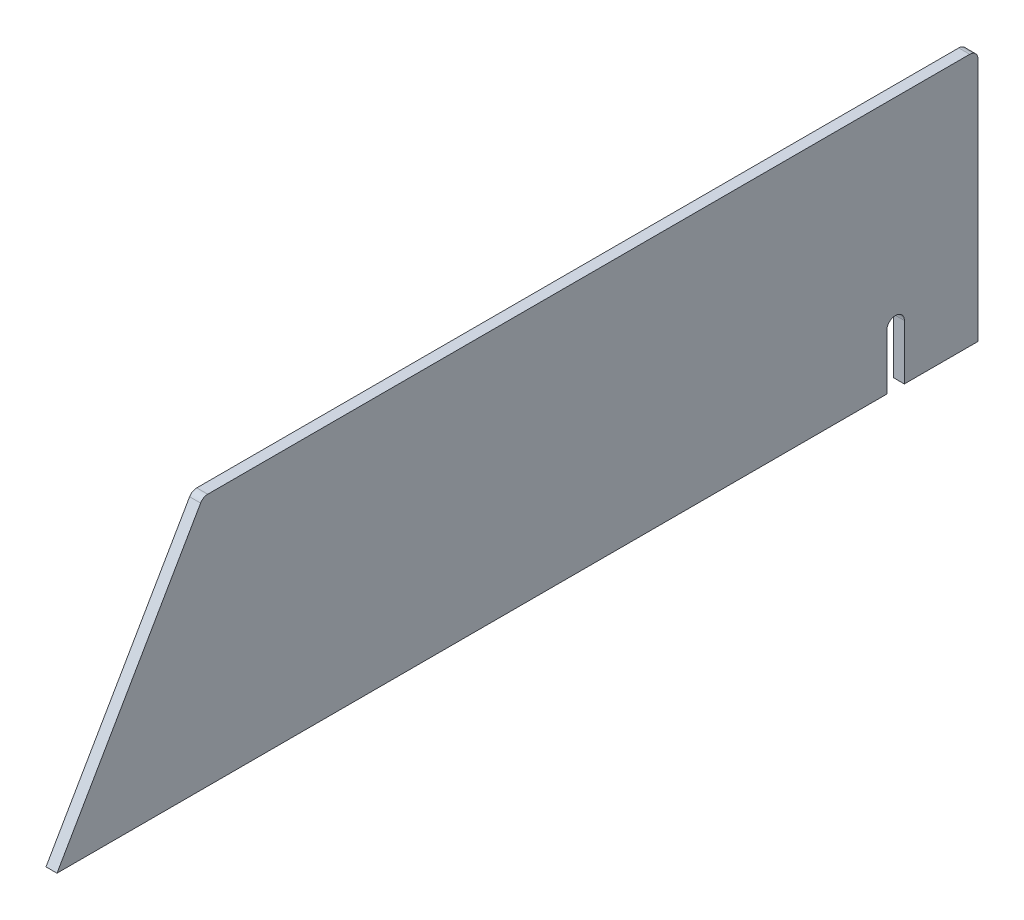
ISO-10303-21;
HEADER;
FILE_DESCRIPTION(('STEP AP214'),'2;1');
FILE_NAME('part.step','',(''),(''),'','','');
FILE_SCHEMA(('AUTOMOTIVE_DESIGN { 1 0 10303 214 1 1 1 1 }'));
ENDSEC;
DATA;
#1=APPLICATION_CONTEXT('core data for automotive mechanical design processes');
#2=APPLICATION_PROTOCOL_DEFINITION('international standard','automotive_design',2000,#1);
#3=PRODUCT_CONTEXT('',#1,'mechanical');
#4=PRODUCT('Part','Part','',(#3));
#5=PRODUCT_RELATED_PRODUCT_CATEGORY('part','',(#4));
#6=PRODUCT_DEFINITION_FORMATION('','',#4);
#7=PRODUCT_DEFINITION_CONTEXT('part definition',#1,'design');
#8=PRODUCT_DEFINITION('design','',#6,#7);
#9=PRODUCT_DEFINITION_SHAPE('','',#8);
#10=(LENGTH_UNIT() NAMED_UNIT(*) SI_UNIT(.MILLI.,.METRE.));
#11=(NAMED_UNIT(*) PLANE_ANGLE_UNIT() SI_UNIT($,.RADIAN.));
#12=(NAMED_UNIT(*) SI_UNIT($,.STERADIAN.) SOLID_ANGLE_UNIT());
#13=UNCERTAINTY_MEASURE_WITH_UNIT(LENGTH_MEASURE(1.E-05),#10,'distance_accuracy_value','');
#14=(GEOMETRIC_REPRESENTATION_CONTEXT(3) GLOBAL_UNCERTAINTY_ASSIGNED_CONTEXT((#13)) GLOBAL_UNIT_ASSIGNED_CONTEXT((#10,
#11,#12)) REPRESENTATION_CONTEXT('',''));
#15=CARTESIAN_POINT('',(0.,0.,0.));
#16=DIRECTION('',(0.,0.,1.));
#17=DIRECTION('',(1.,0.,0.));
#18=AXIS2_PLACEMENT_3D('',#15,#16,#17);
#19=CARTESIAN_POINT('',(2.,-46.,-55.));
#20=DIRECTION('',(0.,1.,0.));
#21=DIRECTION('',(0.,0.,1.));
#22=AXIS2_PLACEMENT_3D('',#19,#20,#21);
#23=PLANE('',#22);
#24=DIRECTION('',(0.,0.,-1.));
#25=VECTOR('',#24,1.);
#26=CARTESIAN_POINT('',(2.,-46.,-55.));
#27=LINE('',#26,#25);
#28=CARTESIAN_POINT('',(2.,-46.,-41.6));
#29=VERTEX_POINT('',#28);
#30=CARTESIAN_POINT('',(2.,-46.,-55.));
#31=VERTEX_POINT('',#30);
#32=EDGE_CURVE('E148',#29,#31,#27,.T.);
#33=ORIENTED_EDGE('',*,*,#32,.F.);
#34=DIRECTION('',(-1.,0.,0.));
#35=VECTOR('',#34,1.);
#36=CARTESIAN_POINT('',(2.,-46.,-41.6));
#37=LINE('',#36,#35);
#38=CARTESIAN_POINT('',(0.,-46.,-41.6));
#39=VERTEX_POINT('',#38);
#40=EDGE_CURVE('E138',#29,#39,#37,.T.);
#41=ORIENTED_EDGE('',*,*,#40,.T.);
#42=DIRECTION('',(0.,0.,-1.));
#43=VECTOR('',#42,1.);
#44=CARTESIAN_POINT('',(0.,-46.,-55.));
#45=LINE('',#44,#43);
#46=CARTESIAN_POINT('',(0.,-46.,-55.));
#47=VERTEX_POINT('',#46);
#48=EDGE_CURVE('E156',#39,#47,#45,.T.);
#49=ORIENTED_EDGE('',*,*,#48,.T.);
#50=DIRECTION('',(-1.,0.,0.));
#51=VECTOR('',#50,1.);
#52=CARTESIAN_POINT('',(2.,-46.,-55.));
#53=LINE('',#52,#51);
#54=EDGE_CURVE('E154',#31,#47,#53,.T.);
#55=ORIENTED_EDGE('',*,*,#54,.F.);
#56=EDGE_LOOP('',(#33,#41,#49,#55));
#57=FACE_BOUND('',#56,.T.);
#58=ADVANCED_FACE('F32',(#57),#23,.F.);
#59=CARTESIAN_POINT('',(2.,-46.,112.558112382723));
#60=DIRECTION('',(0.,-0.500000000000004,-0.866025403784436));
#61=DIRECTION('',(0.,0.866025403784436,-0.500000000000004));
#62=AXIS2_PLACEMENT_3D('',#59,#60,#61);
#63=PLANE('',#62);
#64=DIRECTION('',(0.,-0.866025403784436,0.500000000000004));
#65=VECTOR('',#64,1.);
#66=CARTESIAN_POINT('',(2.,-46.,112.558112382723));
#67=LINE('',#66,#65);
#68=CARTESIAN_POINT('',(2.,-0.749999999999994,86.4330127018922));
#69=VERTEX_POINT('',#68);
#70=CARTESIAN_POINT('',(2.,-46.,112.558112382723));
#71=VERTEX_POINT('',#70);
#72=EDGE_CURVE('E145',#69,#71,#67,.T.);
#73=ORIENTED_EDGE('',*,*,#72,.F.);
#74=DIRECTION('',(-1.,0.,0.));
#75=VECTOR('',#74,1.);
#76=CARTESIAN_POINT('',(2.,-0.750000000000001,86.4330127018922));
#77=LINE('',#76,#75);
#78=CARTESIAN_POINT('',(0.,-0.749999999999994,86.4330127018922));
#79=VERTEX_POINT('',#78);
#80=EDGE_CURVE('E168',#69,#79,#77,.T.);
#81=ORIENTED_EDGE('',*,*,#80,.T.);
#82=DIRECTION('',(0.,-0.866025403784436,0.500000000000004));
#83=VECTOR('',#82,1.);
#84=CARTESIAN_POINT('',(0.,-46.,112.558112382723));
#85=LINE('',#84,#83);
#86=CARTESIAN_POINT('',(0.,-46.,112.558112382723));
#87=VERTEX_POINT('',#86);
#88=EDGE_CURVE('E141',#79,#87,#85,.T.);
#89=ORIENTED_EDGE('',*,*,#88,.T.);
#90=DIRECTION('',(-1.,0.,0.));
#91=VECTOR('',#90,1.);
#92=CARTESIAN_POINT('',(2.,-46.,112.558112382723));
#93=LINE('',#92,#91);
#94=EDGE_CURVE('E165',#71,#87,#93,.T.);
#95=ORIENTED_EDGE('',*,*,#94,.F.);
#96=EDGE_LOOP('',(#73,#81,#89,#95));
#97=FACE_BOUND('',#96,.T.);
#98=ADVANCED_FACE('F193',(#97),#63,.F.);
#99=CARTESIAN_POINT('',(0.,-46.,-38.4));
#100=VERTEX_POINT('',#99);
#101=EDGE_CURVE('E157',#87,#100,#45,.T.);
#102=ORIENTED_EDGE('',*,*,#101,.T.);
#103=DIRECTION('',(1.,0.,0.));
#104=VECTOR('',#103,1.);
#105=CARTESIAN_POINT('',(2.,-46.,-38.4));
#106=LINE('',#105,#104);
#107=CARTESIAN_POINT('',(2.,-46.,-38.4));
#108=VERTEX_POINT('',#107);
#109=EDGE_CURVE('E47',#100,#108,#106,.T.);
#110=ORIENTED_EDGE('',*,*,#109,.T.);
#111=EDGE_CURVE('E149',#71,#108,#27,.T.);
#112=ORIENTED_EDGE('',*,*,#111,.F.);
#113=ORIENTED_EDGE('',*,*,#94,.T.);
#114=EDGE_LOOP('',(#102,#110,#112,#113));
#115=FACE_BOUND('',#114,.T.);
#116=ADVANCED_FACE('F212',(#115),#23,.F.);
#117=CARTESIAN_POINT('',(2.,0.,-55.));
#118=DIRECTION('',(0.,0.,1.));
#119=DIRECTION('',(0.,-1.,0.));
#120=AXIS2_PLACEMENT_3D('',#117,#118,#119);
#121=PLANE('',#120);
#122=DIRECTION('',(0.,1.,0.));
#123=VECTOR('',#122,1.);
#124=CARTESIAN_POINT('',(0.,0.,-55.));
#125=LINE('',#124,#123);
#126=CARTESIAN_POINT('',(0.,-1.5,-55.));
#127=VERTEX_POINT('',#126);
#128=EDGE_CURVE('E159',#47,#127,#125,.T.);
#129=ORIENTED_EDGE('',*,*,#128,.T.);
#130=DIRECTION('',(-1.,0.,0.));
#131=VECTOR('',#130,1.);
#132=CARTESIAN_POINT('',(2.,-1.5,-55.));
#133=LINE('',#132,#131);
#134=CARTESIAN_POINT('',(2.,-1.5,-55.));
#135=VERTEX_POINT('',#134);
#136=EDGE_CURVE('E40',#127,#135,#133,.F.);
#137=ORIENTED_EDGE('',*,*,#136,.T.);
#138=DIRECTION('',(0.,1.,0.));
#139=VECTOR('',#138,1.);
#140=CARTESIAN_POINT('',(2.,0.,-55.));
#141=LINE('',#140,#139);
#142=EDGE_CURVE('E152',#31,#135,#141,.T.);
#143=ORIENTED_EDGE('',*,*,#142,.F.);
#144=ORIENTED_EDGE('',*,*,#54,.T.);
#145=EDGE_LOOP('',(#129,#137,#143,#144));
#146=FACE_BOUND('',#145,.T.);
#147=ADVANCED_FACE('F204',(#146),#121,.F.);
#148=CARTESIAN_POINT('',(2.,0.,0.));
#149=DIRECTION('',(0.,-1.,0.));
#150=DIRECTION('',(0.,0.,-1.));
#151=AXIS2_PLACEMENT_3D('',#148,#149,#150);
#152=PLANE('',#151);
#153=DIRECTION('',(0.,0.,1.));
#154=VECTOR('',#153,1.);
#155=CARTESIAN_POINT('',(0.,0.,0.));
#156=LINE('',#155,#154);
#157=CARTESIAN_POINT('',(0.,0.,-53.5));
#158=VERTEX_POINT('',#157);
#159=CARTESIAN_POINT('',(0.,0.,85.1339745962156));
#160=VERTEX_POINT('',#159);
#161=EDGE_CURVE('E146',#158,#160,#156,.T.);
#162=ORIENTED_EDGE('',*,*,#161,.T.);
#163=DIRECTION('',(-1.,0.,0.));
#164=VECTOR('',#163,1.);
#165=CARTESIAN_POINT('',(2.,0.,85.1339745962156));
#166=LINE('',#165,#164);
#167=CARTESIAN_POINT('',(2.,0.,85.1339745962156));
#168=VERTEX_POINT('',#167);
#169=EDGE_CURVE('E178',#160,#168,#166,.F.);
#170=ORIENTED_EDGE('',*,*,#169,.T.);
#171=DIRECTION('',(0.,0.,1.));
#172=VECTOR('',#171,1.);
#173=CARTESIAN_POINT('',(2.,0.,86.));
#174=LINE('',#173,#172);
#175=CARTESIAN_POINT('',(2.,0.,-53.5));
#176=VERTEX_POINT('',#175);
#177=EDGE_CURVE('E142',#176,#168,#174,.T.);
#178=ORIENTED_EDGE('',*,*,#177,.F.);
#179=DIRECTION('',(-1.,0.,0.));
#180=VECTOR('',#179,1.);
#181=CARTESIAN_POINT('',(2.,0.,-53.5));
#182=LINE('',#181,#180);
#183=EDGE_CURVE('E175',#176,#158,#182,.T.);
#184=ORIENTED_EDGE('',*,*,#183,.T.);
#185=EDGE_LOOP('',(#162,#170,#178,#184));
#186=FACE_BOUND('',#185,.T.);
#187=ADVANCED_FACE('F199',(#186),#152,.F.);
#188=CARTESIAN_POINT('',(2.,0.,0.));
#189=DIRECTION('',(-1.,0.,0.));
#190=DIRECTION('',(0.,0.,1.));
#191=AXIS2_PLACEMENT_3D('',#188,#189,#190);
#192=PLANE('',#191);
#193=CARTESIAN_POINT('',(2.,-36.,-40.));
#194=DIRECTION('',(1.,0.,0.));
#195=DIRECTION('',(0.,0.,-1.));
#196=AXIS2_PLACEMENT_3D('',#193,#194,#195);
#197=CIRCLE('',#196,1.6);
#198=CARTESIAN_POINT('',(2.,-36.,-41.6));
#199=VERTEX_POINT('',#198);
#200=CARTESIAN_POINT('',(2.,-36.,-38.4));
#201=VERTEX_POINT('',#200);
#202=EDGE_CURVE('E117',#199,#201,#197,.T.);
#203=ORIENTED_EDGE('',*,*,#202,.F.);
#204=DIRECTION('',(0.,1.,0.));
#205=VECTOR('',#204,1.);
#206=CARTESIAN_POINT('',(2.,-36.,-41.6));
#207=LINE('',#206,#205);
#208=EDGE_CURVE('E129',#29,#199,#207,.T.);
#209=ORIENTED_EDGE('',*,*,#208,.F.);
#210=ORIENTED_EDGE('',*,*,#32,.T.);
#211=ORIENTED_EDGE('',*,*,#142,.T.);
#212=CARTESIAN_POINT('',(2.,-1.5,-53.5));
#213=DIRECTION('',(-1.,0.,0.));
#214=DIRECTION('',(0.,0.,1.));
#215=AXIS2_PLACEMENT_3D('',#212,#213,#214);
#216=CIRCLE('',#215,1.5);
#217=EDGE_CURVE('E180',#135,#176,#216,.F.);
#218=ORIENTED_EDGE('',*,*,#217,.T.);
#219=ORIENTED_EDGE('',*,*,#177,.T.);
#220=CARTESIAN_POINT('',(2.,-1.5,85.1339745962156));
#221=DIRECTION('',(-1.,0.,0.));
#222=DIRECTION('',(0.,0.,1.));
#223=AXIS2_PLACEMENT_3D('',#220,#221,#222);
#224=CIRCLE('',#223,1.5);
#225=EDGE_CURVE('E182',#168,#69,#224,.F.);
#226=ORIENTED_EDGE('',*,*,#225,.T.);
#227=ORIENTED_EDGE('',*,*,#72,.T.);
#228=ORIENTED_EDGE('',*,*,#111,.T.);
#229=DIRECTION('',(0.,-1.,0.));
#230=VECTOR('',#229,1.);
#231=CARTESIAN_POINT('',(2.,-36.,-38.4));
#232=LINE('',#231,#230);
#233=EDGE_CURVE('E131',#201,#108,#232,.T.);
#234=ORIENTED_EDGE('',*,*,#233,.F.);
#235=EDGE_LOOP('',(#203,#209,#210,#211,#218,#219,#226,#227,#228,#234));
#236=FACE_BOUND('',#235,.T.);
#237=ADVANCED_FACE('F186',(#236),#192,.F.);
#238=CARTESIAN_POINT('',(0.,0.,0.));
#239=DIRECTION('',(-1.,0.,0.));
#240=DIRECTION('',(0.,0.,1.));
#241=AXIS2_PLACEMENT_3D('',#238,#239,#240);
#242=PLANE('',#241);
#243=DIRECTION('',(0.,-1.,0.));
#244=VECTOR('',#243,1.);
#245=CARTESIAN_POINT('',(0.,0.,-41.6));
#246=LINE('',#245,#244);
#247=CARTESIAN_POINT('',(0.,-36.,-41.6));
#248=VERTEX_POINT('',#247);
#249=EDGE_CURVE('E11',#248,#39,#246,.T.);
#250=ORIENTED_EDGE('',*,*,#249,.F.);
#251=CARTESIAN_POINT('',(0.,-36.,-40.));
#252=DIRECTION('',(1.,0.,0.));
#253=DIRECTION('',(0.,0.,-1.));
#254=AXIS2_PLACEMENT_3D('',#251,#252,#253);
#255=CIRCLE('',#254,1.6);
#256=CARTESIAN_POINT('',(0.,-36.,-38.4));
#257=VERTEX_POINT('',#256);
#258=EDGE_CURVE('E114',#248,#257,#255,.T.);
#259=ORIENTED_EDGE('',*,*,#258,.T.);
#260=DIRECTION('',(0.,-1.,0.));
#261=VECTOR('',#260,1.);
#262=CARTESIAN_POINT('',(0.,-36.,-38.4));
#263=LINE('',#262,#261);
#264=EDGE_CURVE('E120',#257,#100,#263,.T.);
#265=ORIENTED_EDGE('',*,*,#264,.T.);
#266=ORIENTED_EDGE('',*,*,#101,.F.);
#267=ORIENTED_EDGE('',*,*,#88,.F.);
#268=CARTESIAN_POINT('',(0.,-1.5,85.1339745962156));
#269=DIRECTION('',(-1.,0.,0.));
#270=DIRECTION('',(0.,0.,1.));
#271=AXIS2_PLACEMENT_3D('',#268,#269,#270);
#272=CIRCLE('',#271,1.5);
#273=EDGE_CURVE('E173',#79,#160,#272,.T.);
#274=ORIENTED_EDGE('',*,*,#273,.T.);
#275=ORIENTED_EDGE('',*,*,#161,.F.);
#276=CARTESIAN_POINT('',(0.,-1.5,-53.5));
#277=DIRECTION('',(-1.,0.,0.));
#278=DIRECTION('',(0.,0.,1.));
#279=AXIS2_PLACEMENT_3D('',#276,#277,#278);
#280=CIRCLE('',#279,1.5);
#281=EDGE_CURVE('E171',#158,#127,#280,.T.);
#282=ORIENTED_EDGE('',*,*,#281,.T.);
#283=ORIENTED_EDGE('',*,*,#128,.F.);
#284=ORIENTED_EDGE('',*,*,#48,.F.);
#285=EDGE_LOOP('',(#250,#259,#265,#266,#267,#274,#275,#282,#283,#284));
#286=FACE_BOUND('',#285,.T.);
#287=ADVANCED_FACE('F127',(#286),#242,.T.);
#288=CARTESIAN_POINT('',(2.,-1.5,85.1339745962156));
#289=DIRECTION('',(-1.,0.,0.));
#290=DIRECTION('',(0.,0.,1.));
#291=AXIS2_PLACEMENT_3D('',#288,#289,#290);
#292=CYLINDRICAL_SURFACE('',#291,1.5);
#293=ORIENTED_EDGE('',*,*,#225,.F.);
#294=ORIENTED_EDGE('',*,*,#169,.F.);
#295=ORIENTED_EDGE('',*,*,#273,.F.);
#296=ORIENTED_EDGE('',*,*,#80,.F.);
#297=EDGE_LOOP('',(#293,#294,#295,#296));
#298=FACE_BOUND('',#297,.T.);
#299=ADVANCED_FACE('F196',(#298),#292,.T.);
#300=CARTESIAN_POINT('',(2.,-1.5,-53.5));
#301=DIRECTION('',(-1.,0.,0.));
#302=DIRECTION('',(0.,0.,1.));
#303=AXIS2_PLACEMENT_3D('',#300,#301,#302);
#304=CYLINDRICAL_SURFACE('',#303,1.5);
#305=ORIENTED_EDGE('',*,*,#217,.F.);
#306=ORIENTED_EDGE('',*,*,#136,.F.);
#307=ORIENTED_EDGE('',*,*,#281,.F.);
#308=ORIENTED_EDGE('',*,*,#183,.F.);
#309=EDGE_LOOP('',(#305,#306,#307,#308));
#310=FACE_BOUND('',#309,.T.);
#311=ADVANCED_FACE('F34',(#310),#304,.T.);
#312=CARTESIAN_POINT('',(0.,-36.,-41.6));
#313=DIRECTION('',(0.,0.,-1.));
#314=DIRECTION('',(-1.,0.,0.));
#315=AXIS2_PLACEMENT_3D('',#312,#313,#314);
#316=PLANE('',#315);
#317=ORIENTED_EDGE('',*,*,#208,.T.);
#318=DIRECTION('',(1.,0.,0.));
#319=VECTOR('',#318,1.);
#320=CARTESIAN_POINT('',(0.,-36.,-41.6));
#321=LINE('',#320,#319);
#322=EDGE_CURVE('E119',#248,#199,#321,.T.);
#323=ORIENTED_EDGE('',*,*,#322,.F.);
#324=ORIENTED_EDGE('',*,*,#249,.T.);
#325=ORIENTED_EDGE('',*,*,#40,.F.);
#326=EDGE_LOOP('',(#317,#323,#324,#325));
#327=FACE_BOUND('',#326,.T.);
#328=ADVANCED_FACE('F210',(#327),#316,.F.);
#329=CARTESIAN_POINT('',(0.,-36.,-38.4));
#330=DIRECTION('',(0.,0.,1.));
#331=DIRECTION('',(1.,0.,0.));
#332=AXIS2_PLACEMENT_3D('',#329,#330,#331);
#333=PLANE('',#332);
#334=ORIENTED_EDGE('',*,*,#264,.F.);
#335=DIRECTION('',(1.,0.,0.));
#336=VECTOR('',#335,1.);
#337=CARTESIAN_POINT('',(0.,-36.,-38.4));
#338=LINE('',#337,#336);
#339=EDGE_CURVE('E110',#257,#201,#338,.T.);
#340=ORIENTED_EDGE('',*,*,#339,.T.);
#341=ORIENTED_EDGE('',*,*,#233,.T.);
#342=ORIENTED_EDGE('',*,*,#109,.F.);
#343=EDGE_LOOP('',(#334,#340,#341,#342));
#344=FACE_BOUND('',#343,.T.);
#345=ADVANCED_FACE('F122',(#344),#333,.F.);
#346=CARTESIAN_POINT('',(0.,-36.,-40.));
#347=DIRECTION('',(1.,0.,0.));
#348=DIRECTION('',(0.,0.,-1.));
#349=AXIS2_PLACEMENT_3D('',#346,#347,#348);
#350=CYLINDRICAL_SURFACE('',#349,1.6);
#351=ORIENTED_EDGE('',*,*,#202,.T.);
#352=ORIENTED_EDGE('',*,*,#339,.F.);
#353=ORIENTED_EDGE('',*,*,#258,.F.);
#354=ORIENTED_EDGE('',*,*,#322,.T.);
#355=EDGE_LOOP('',(#351,#352,#353,#354));
#356=FACE_BOUND('',#355,.T.);
#357=ADVANCED_FACE('F111',(#356),#350,.F.);
#358=CLOSED_SHELL('',(#58,#98,#116,#147,#187,#237,#287,#299,#311,#328,#345,#357));
#359=MANIFOLD_SOLID_BREP('B2',#358);
#360=ADVANCED_BREP_SHAPE_REPRESENTATION('',(#18,#359),#14);
#361=SHAPE_DEFINITION_REPRESENTATION(#9,#360);
ENDSEC;
END-ISO-10303-21;
